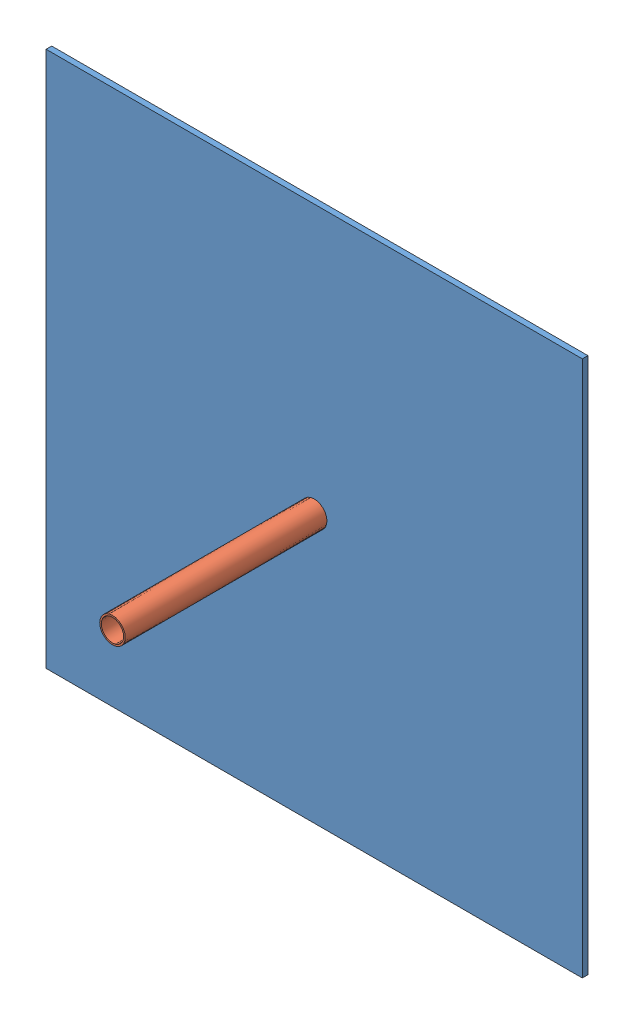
SolidWorks assembly Assem1.sldasm, configuration Default (file format 8000). Lengths in mm.
Overall size (266.7 266.7 103.12).
2 component instances, 2 part files, 2 mates.
Components (placement in the parent):
- Top Plate-1: Top Plate.SLDPRT [Default] at (-16.9168 285.284 185.7302) size (266.7 266.7 2.79)
- Tube For Top-1: Tube For Top.SLDPRT [Default] at (116.4332 151.934 288.8542) x (1 0 0) z (0 1 0) size (12.7 100.33 12.7)
Mates (geometry in assembly coordinates):
- Coincident1: coincident: plane of Top Plate-1 through (-16.9168 285.284 188.5242) normal (0 0 1); circle of Tube For Top-1
- Concentric1: concentric aligned: cylinder of Top Plate-1 through (116.4332 151.934 185.7302) axis (0 0 1) radius 0.7937; cylinder of Tube For Top-1 through (116.4332 151.934 188.5242) axis (0 0 1) radius 5.5563
